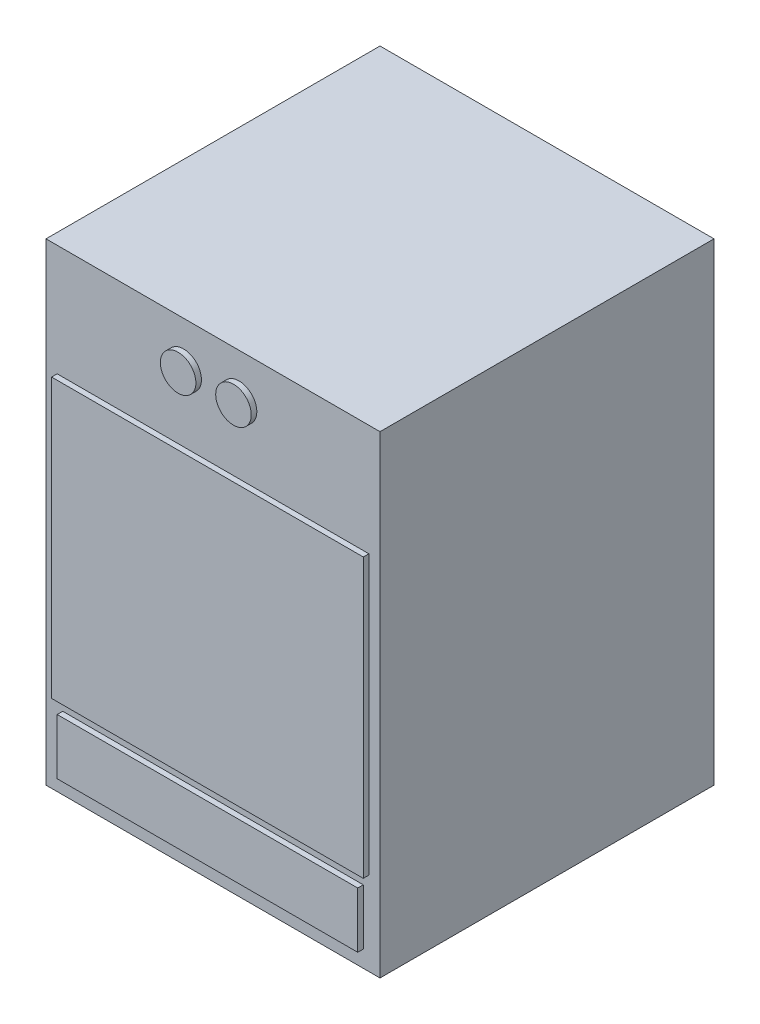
ISO-10303-21;
HEADER;
FILE_DESCRIPTION(('STEP AP214'),'2;1');
FILE_NAME('part.step','',(''),(''),'','','');
FILE_SCHEMA(('AUTOMOTIVE_DESIGN { 1 0 10303 214 1 1 1 1 }'));
ENDSEC;
DATA;
#1=APPLICATION_CONTEXT('core data for automotive mechanical design processes');
#2=APPLICATION_PROTOCOL_DEFINITION('international standard','automotive_design',2000,#1);
#3=PRODUCT_CONTEXT('',#1,'mechanical');
#4=PRODUCT('Part','Part','',(#3));
#5=PRODUCT_RELATED_PRODUCT_CATEGORY('part','',(#4));
#6=PRODUCT_DEFINITION_FORMATION('','',#4);
#7=PRODUCT_DEFINITION_CONTEXT('part definition',#1,'design');
#8=PRODUCT_DEFINITION('design','',#6,#7);
#9=PRODUCT_DEFINITION_SHAPE('','',#8);
#10=(LENGTH_UNIT() NAMED_UNIT(*) SI_UNIT(.MILLI.,.METRE.));
#11=(NAMED_UNIT(*) PLANE_ANGLE_UNIT() SI_UNIT($,.RADIAN.));
#12=(NAMED_UNIT(*) SI_UNIT($,.STERADIAN.) SOLID_ANGLE_UNIT());
#13=UNCERTAINTY_MEASURE_WITH_UNIT(LENGTH_MEASURE(1.E-05),#10,'distance_accuracy_value','');
#14=(GEOMETRIC_REPRESENTATION_CONTEXT(3) GLOBAL_UNCERTAINTY_ASSIGNED_CONTEXT((#13)) GLOBAL_UNIT_ASSIGNED_CONTEXT((#10,
#11,#12)) REPRESENTATION_CONTEXT('',''));
#15=CARTESIAN_POINT('',(0.,0.,0.));
#16=DIRECTION('',(0.,0.,1.));
#17=DIRECTION('',(1.,0.,0.));
#18=AXIS2_PLACEMENT_3D('',#15,#16,#17);
#19=CARTESIAN_POINT('',(300.,850.,300.));
#20=DIRECTION('',(0.,0.,-1.));
#21=DIRECTION('',(-1.,0.,0.));
#22=AXIS2_PLACEMENT_3D('',#19,#20,#21);
#23=PLANE('',#22);
#24=DIRECTION('',(0.,-1.,0.));
#25=VECTOR('',#24,1.);
#26=CARTESIAN_POINT('',(-270.,30.,300.));
#27=LINE('',#26,#25);
#28=CARTESIAN_POINT('',(-270.,130.,300.));
#29=VERTEX_POINT('',#28);
#30=CARTESIAN_POINT('',(-270.,30.,300.));
#31=VERTEX_POINT('',#30);
#32=EDGE_CURVE('E142',#29,#31,#27,.T.);
#33=ORIENTED_EDGE('',*,*,#32,.F.);
#34=DIRECTION('',(-1.,0.,0.));
#35=VECTOR('',#34,1.);
#36=CARTESIAN_POINT('',(-270.,130.,300.));
#37=LINE('',#36,#35);
#38=CARTESIAN_POINT('',(270.,130.,300.));
#39=VERTEX_POINT('',#38);
#40=EDGE_CURVE('E155',#39,#29,#37,.T.);
#41=ORIENTED_EDGE('',*,*,#40,.F.);
#42=DIRECTION('',(0.,1.,0.));
#43=VECTOR('',#42,1.);
#44=CARTESIAN_POINT('',(270.,30.,300.));
#45=LINE('',#44,#43);
#46=CARTESIAN_POINT('',(270.,30.,300.));
#47=VERTEX_POINT('',#46);
#48=EDGE_CURVE('E164',#47,#39,#45,.T.);
#49=ORIENTED_EDGE('',*,*,#48,.F.);
#50=DIRECTION('',(1.,0.,0.));
#51=VECTOR('',#50,1.);
#52=CARTESIAN_POINT('',(-270.,30.,300.));
#53=LINE('',#52,#51);
#54=EDGE_CURVE('E145',#31,#47,#53,.T.);
#55=ORIENTED_EDGE('',*,*,#54,.F.);
#56=EDGE_LOOP('',(#33,#41,#49,#55));
#57=FACE_BOUND('',#56,.T.);
#58=CARTESIAN_POINT('',(46.7714451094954,770.356504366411,300.));
#59=DIRECTION('',(0.,0.,-1.));
#60=DIRECTION('',(-1.,0.,0.));
#61=AXIS2_PLACEMENT_3D('',#58,#59,#60);
#62=CIRCLE('',#61,31.9295040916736);
#63=CARTESIAN_POINT('',(14.8419410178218,770.356504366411,300.));
#64=VERTEX_POINT('',#63);
#65=EDGE_CURVE('E11',#64,#64,#62,.F.);
#66=ORIENTED_EDGE('',*,*,#65,.F.);
#67=EDGE_LOOP('',(#66));
#68=FACE_BOUND('',#67,.T.);
#69=CARTESIAN_POINT('',(-52.7012407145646,770.356504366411,300.));
#70=DIRECTION('',(0.,0.,-1.));
#71=DIRECTION('',(-1.,0.,0.));
#72=AXIS2_PLACEMENT_3D('',#69,#70,#71);
#73=CIRCLE('',#72,31.9295040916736);
#74=CARTESIAN_POINT('',(-84.6307448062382,770.356504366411,300.));
#75=VERTEX_POINT('',#74);
#76=EDGE_CURVE('E40',#75,#75,#73,.F.);
#77=ORIENTED_EDGE('',*,*,#76,.F.);
#78=EDGE_LOOP('',(#77));
#79=FACE_BOUND('',#78,.T.);
#80=DIRECTION('',(1.,0.,0.));
#81=VECTOR('',#80,1.);
#82=CARTESIAN_POINT('',(300.,0.,300.));
#83=LINE('',#82,#81);
#84=CARTESIAN_POINT('',(-300.,0.,300.));
#85=VERTEX_POINT('',#84);
#86=CARTESIAN_POINT('',(300.,0.,300.));
#87=VERTEX_POINT('',#86);
#88=EDGE_CURVE('E200',#85,#87,#83,.T.);
#89=ORIENTED_EDGE('',*,*,#88,.T.);
#90=DIRECTION('',(0.,-1.,0.));
#91=VECTOR('',#90,1.);
#92=CARTESIAN_POINT('',(300.,850.,300.));
#93=LINE('',#92,#91);
#94=CARTESIAN_POINT('',(300.,850.,300.));
#95=VERTEX_POINT('',#94);
#96=EDGE_CURVE('E210',#95,#87,#93,.T.);
#97=ORIENTED_EDGE('',*,*,#96,.F.);
#98=DIRECTION('',(1.,0.,0.));
#99=VECTOR('',#98,1.);
#100=CARTESIAN_POINT('',(300.,850.,300.));
#101=LINE('',#100,#99);
#102=CARTESIAN_POINT('',(-300.,850.,300.));
#103=VERTEX_POINT('',#102);
#104=EDGE_CURVE('E190',#103,#95,#101,.T.);
#105=ORIENTED_EDGE('',*,*,#104,.F.);
#106=DIRECTION('',(0.,-1.,0.));
#107=VECTOR('',#106,1.);
#108=CARTESIAN_POINT('',(-300.,850.,300.));
#109=LINE('',#108,#107);
#110=EDGE_CURVE('E213',#103,#85,#109,.T.);
#111=ORIENTED_EDGE('',*,*,#110,.T.);
#112=EDGE_LOOP('',(#89,#97,#105,#111));
#113=FACE_BOUND('',#112,.T.);
#114=DIRECTION('',(0.,-1.,0.));
#115=VECTOR('',#114,1.);
#116=CARTESIAN_POINT('',(-280.,150.,300.));
#117=LINE('',#116,#115);
#118=CARTESIAN_POINT('',(-280.,650.,300.));
#119=VERTEX_POINT('',#118);
#120=CARTESIAN_POINT('',(-280.,150.,300.));
#121=VERTEX_POINT('',#120);
#122=EDGE_CURVE('E141',#119,#121,#117,.T.);
#123=ORIENTED_EDGE('',*,*,#122,.F.);
#124=DIRECTION('',(-1.,0.,0.));
#125=VECTOR('',#124,1.);
#126=CARTESIAN_POINT('',(-280.,650.,300.));
#127=LINE('',#126,#125);
#128=CARTESIAN_POINT('',(280.,650.,300.));
#129=VERTEX_POINT('',#128);
#130=EDGE_CURVE('E138',#129,#119,#127,.T.);
#131=ORIENTED_EDGE('',*,*,#130,.F.);
#132=DIRECTION('',(0.,1.,0.));
#133=VECTOR('',#132,1.);
#134=CARTESIAN_POINT('',(280.,150.,300.));
#135=LINE('',#134,#133);
#136=CARTESIAN_POINT('',(280.,150.,300.));
#137=VERTEX_POINT('',#136);
#138=EDGE_CURVE('E52',#137,#129,#135,.T.);
#139=ORIENTED_EDGE('',*,*,#138,.F.);
#140=DIRECTION('',(1.,0.,0.));
#141=VECTOR('',#140,1.);
#142=CARTESIAN_POINT('',(-280.,150.,300.));
#143=LINE('',#142,#141);
#144=EDGE_CURVE('E47',#121,#137,#143,.T.);
#145=ORIENTED_EDGE('',*,*,#144,.F.);
#146=EDGE_LOOP('',(#123,#131,#139,#145));
#147=FACE_BOUND('',#146,.T.);
#148=ADVANCED_FACE('F32',(#57,#68,#79,#113,#147),#23,.F.);
#149=CARTESIAN_POINT('',(-300.,850.,300.));
#150=DIRECTION('',(1.,0.,0.));
#151=DIRECTION('',(0.,0.,-1.));
#152=AXIS2_PLACEMENT_3D('',#149,#150,#151);
#153=PLANE('',#152);
#154=DIRECTION('',(0.,0.,1.));
#155=VECTOR('',#154,1.);
#156=CARTESIAN_POINT('',(-300.,0.,300.));
#157=LINE('',#156,#155);
#158=CARTESIAN_POINT('',(-300.,0.,-300.));
#159=VERTEX_POINT('',#158);
#160=EDGE_CURVE('E186',#159,#85,#157,.T.);
#161=ORIENTED_EDGE('',*,*,#160,.T.);
#162=ORIENTED_EDGE('',*,*,#110,.F.);
#163=DIRECTION('',(0.,0.,1.));
#164=VECTOR('',#163,1.);
#165=CARTESIAN_POINT('',(-300.,850.,300.));
#166=LINE('',#165,#164);
#167=CARTESIAN_POINT('',(-300.,850.,-300.));
#168=VERTEX_POINT('',#167);
#169=EDGE_CURVE('E187',#168,#103,#166,.T.);
#170=ORIENTED_EDGE('',*,*,#169,.F.);
#171=DIRECTION('',(0.,-1.,0.));
#172=VECTOR('',#171,1.);
#173=CARTESIAN_POINT('',(-300.,850.,-300.));
#174=LINE('',#173,#172);
#175=EDGE_CURVE('E197',#168,#159,#174,.T.);
#176=ORIENTED_EDGE('',*,*,#175,.T.);
#177=EDGE_LOOP('',(#161,#162,#170,#176));
#178=FACE_BOUND('',#177,.T.);
#179=ADVANCED_FACE('F34',(#178),#153,.F.);
#180=CARTESIAN_POINT('',(300.,850.,300.));
#181=DIRECTION('',(-1.,0.,0.));
#182=DIRECTION('',(0.,0.,1.));
#183=AXIS2_PLACEMENT_3D('',#180,#181,#182);
#184=PLANE('',#183);
#185=DIRECTION('',(0.,0.,-1.));
#186=VECTOR('',#185,1.);
#187=CARTESIAN_POINT('',(300.,0.,300.));
#188=LINE('',#187,#186);
#189=CARTESIAN_POINT('',(300.,0.,-300.));
#190=VERTEX_POINT('',#189);
#191=EDGE_CURVE('E202',#87,#190,#188,.T.);
#192=ORIENTED_EDGE('',*,*,#191,.T.);
#193=DIRECTION('',(0.,-1.,0.));
#194=VECTOR('',#193,1.);
#195=CARTESIAN_POINT('',(300.,850.,-300.));
#196=LINE('',#195,#194);
#197=CARTESIAN_POINT('',(300.,850.,-300.));
#198=VERTEX_POINT('',#197);
#199=EDGE_CURVE('E207',#198,#190,#196,.T.);
#200=ORIENTED_EDGE('',*,*,#199,.F.);
#201=DIRECTION('',(0.,0.,-1.));
#202=VECTOR('',#201,1.);
#203=CARTESIAN_POINT('',(300.,850.,300.));
#204=LINE('',#203,#202);
#205=EDGE_CURVE('E193',#95,#198,#204,.T.);
#206=ORIENTED_EDGE('',*,*,#205,.F.);
#207=ORIENTED_EDGE('',*,*,#96,.T.);
#208=EDGE_LOOP('',(#192,#200,#206,#207));
#209=FACE_BOUND('',#208,.T.);
#210=ADVANCED_FACE('F297',(#209),#184,.F.);
#211=CARTESIAN_POINT('',(300.,850.,-300.));
#212=DIRECTION('',(0.,0.,1.));
#213=DIRECTION('',(1.,0.,0.));
#214=AXIS2_PLACEMENT_3D('',#211,#212,#213);
#215=PLANE('',#214);
#216=DIRECTION('',(-1.,0.,0.));
#217=VECTOR('',#216,1.);
#218=CARTESIAN_POINT('',(300.,0.,-300.));
#219=LINE('',#218,#217);
#220=EDGE_CURVE('E191',#190,#159,#219,.T.);
#221=ORIENTED_EDGE('',*,*,#220,.T.);
#222=ORIENTED_EDGE('',*,*,#175,.F.);
#223=DIRECTION('',(-1.,0.,0.));
#224=VECTOR('',#223,1.);
#225=CARTESIAN_POINT('',(300.,850.,-300.));
#226=LINE('',#225,#224);
#227=EDGE_CURVE('E195',#198,#168,#226,.T.);
#228=ORIENTED_EDGE('',*,*,#227,.F.);
#229=ORIENTED_EDGE('',*,*,#199,.T.);
#230=EDGE_LOOP('',(#221,#222,#228,#229));
#231=FACE_BOUND('',#230,.T.);
#232=ADVANCED_FACE('F290',(#231),#215,.F.);
#233=CARTESIAN_POINT('',(0.,850.,0.));
#234=DIRECTION('',(0.,1.,0.));
#235=DIRECTION('',(0.,0.,1.));
#236=AXIS2_PLACEMENT_3D('',#233,#234,#235);
#237=PLANE('',#236);
#238=ORIENTED_EDGE('',*,*,#169,.T.);
#239=ORIENTED_EDGE('',*,*,#104,.T.);
#240=ORIENTED_EDGE('',*,*,#205,.T.);
#241=ORIENTED_EDGE('',*,*,#227,.T.);
#242=EDGE_LOOP('',(#238,#239,#240,#241));
#243=FACE_BOUND('',#242,.T.);
#244=ADVANCED_FACE('F287',(#243),#237,.T.);
#245=CARTESIAN_POINT('',(0.,0.,0.));
#246=DIRECTION('',(0.,1.,0.));
#247=DIRECTION('',(0.,0.,1.));
#248=AXIS2_PLACEMENT_3D('',#245,#246,#247);
#249=PLANE('',#248);
#250=ORIENTED_EDGE('',*,*,#160,.F.);
#251=ORIENTED_EDGE('',*,*,#220,.F.);
#252=ORIENTED_EDGE('',*,*,#191,.F.);
#253=ORIENTED_EDGE('',*,*,#88,.F.);
#254=EDGE_LOOP('',(#250,#251,#252,#253));
#255=FACE_BOUND('',#254,.T.);
#256=ADVANCED_FACE('F285',(#255),#249,.F.);
#257=CARTESIAN_POINT('',(-52.7012407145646,770.356504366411,310.));
#258=DIRECTION('',(0.,0.,-1.));
#259=DIRECTION('',(-1.,0.,0.));
#260=AXIS2_PLACEMENT_3D('',#257,#258,#259);
#261=CYLINDRICAL_SURFACE('',#260,31.9295040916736);
#262=CARTESIAN_POINT('',(-52.7012407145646,770.356504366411,310.));
#263=DIRECTION('',(0.,0.,1.));
#264=DIRECTION('',(1.,0.,0.));
#265=AXIS2_PLACEMENT_3D('',#262,#263,#264);
#266=CIRCLE('',#265,31.9295040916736);
#267=CARTESIAN_POINT('',(-20.771736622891,770.356504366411,310.));
#268=VERTEX_POINT('',#267);
#269=EDGE_CURVE('E183',#268,#268,#266,.T.);
#270=ORIENTED_EDGE('',*,*,#269,.F.);
#271=EDGE_LOOP('',(#270));
#272=FACE_BOUND('',#271,.T.);
#273=ORIENTED_EDGE('',*,*,#76,.T.);
#274=EDGE_LOOP('',(#273));
#275=FACE_BOUND('',#274,.T.);
#276=ADVANCED_FACE('F218',(#272,#275),#261,.T.);
#277=CARTESIAN_POINT('',(-52.7012407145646,770.356504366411,310.));
#278=DIRECTION('',(0.,0.,1.));
#279=DIRECTION('',(1.,0.,0.));
#280=AXIS2_PLACEMENT_3D('',#277,#278,#279);
#281=PLANE('',#280);
#282=ORIENTED_EDGE('',*,*,#269,.T.);
#283=EDGE_LOOP('',(#282));
#284=FACE_BOUND('',#283,.T.);
#285=ADVANCED_FACE('F278',(#284),#281,.T.);
#286=CARTESIAN_POINT('',(46.7714451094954,770.356504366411,310.));
#287=DIRECTION('',(0.,0.,-1.));
#288=DIRECTION('',(-1.,0.,0.));
#289=AXIS2_PLACEMENT_3D('',#286,#287,#288);
#290=CYLINDRICAL_SURFACE('',#289,31.9295040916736);
#291=CARTESIAN_POINT('',(46.7714451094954,770.356504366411,310.));
#292=DIRECTION('',(0.,0.,1.));
#293=DIRECTION('',(1.,0.,0.));
#294=AXIS2_PLACEMENT_3D('',#291,#292,#293);
#295=CIRCLE('',#294,31.9295040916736);
#296=CARTESIAN_POINT('',(78.700949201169,770.356504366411,310.));
#297=VERTEX_POINT('',#296);
#298=EDGE_CURVE('E180',#297,#297,#295,.T.);
#299=ORIENTED_EDGE('',*,*,#298,.F.);
#300=EDGE_LOOP('',(#299));
#301=FACE_BOUND('',#300,.T.);
#302=ORIENTED_EDGE('',*,*,#65,.T.);
#303=EDGE_LOOP('',(#302));
#304=FACE_BOUND('',#303,.T.);
#305=ADVANCED_FACE('F274',(#301,#304),#290,.T.);
#306=CARTESIAN_POINT('',(46.7714451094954,770.356504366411,310.));
#307=DIRECTION('',(0.,0.,1.));
#308=DIRECTION('',(1.,0.,0.));
#309=AXIS2_PLACEMENT_3D('',#306,#307,#308);
#310=PLANE('',#309);
#311=ORIENTED_EDGE('',*,*,#298,.T.);
#312=EDGE_LOOP('',(#311));
#313=FACE_BOUND('',#312,.T.);
#314=ADVANCED_FACE('F270',(#313),#310,.T.);
#315=CARTESIAN_POINT('',(-270.,30.,310.));
#316=DIRECTION('',(1.,0.,0.));
#317=DIRECTION('',(0.,0.,-1.));
#318=AXIS2_PLACEMENT_3D('',#315,#316,#317);
#319=PLANE('',#318);
#320=ORIENTED_EDGE('',*,*,#32,.T.);
#321=DIRECTION('',(0.,0.,-1.));
#322=VECTOR('',#321,1.);
#323=CARTESIAN_POINT('',(-270.,30.,310.));
#324=LINE('',#323,#322);
#325=CARTESIAN_POINT('',(-270.,30.,310.));
#326=VERTEX_POINT('',#325);
#327=EDGE_CURVE('E177',#326,#31,#324,.T.);
#328=ORIENTED_EDGE('',*,*,#327,.F.);
#329=DIRECTION('',(0.,-1.,0.));
#330=VECTOR('',#329,1.);
#331=CARTESIAN_POINT('',(-270.,30.,310.));
#332=LINE('',#331,#330);
#333=CARTESIAN_POINT('',(-270.,130.,310.));
#334=VERTEX_POINT('',#333);
#335=EDGE_CURVE('E151',#334,#326,#332,.T.);
#336=ORIENTED_EDGE('',*,*,#335,.F.);
#337=DIRECTION('',(0.,0.,-1.));
#338=VECTOR('',#337,1.);
#339=CARTESIAN_POINT('',(-270.,130.,310.));
#340=LINE('',#339,#338);
#341=EDGE_CURVE('E160',#334,#29,#340,.T.);
#342=ORIENTED_EDGE('',*,*,#341,.T.);
#343=EDGE_LOOP('',(#320,#328,#336,#342));
#344=FACE_BOUND('',#343,.T.);
#345=ADVANCED_FACE('F266',(#344),#319,.F.);
#346=CARTESIAN_POINT('',(-270.,30.,310.));
#347=DIRECTION('',(0.,1.,0.));
#348=DIRECTION('',(0.,0.,1.));
#349=AXIS2_PLACEMENT_3D('',#346,#347,#348);
#350=PLANE('',#349);
#351=ORIENTED_EDGE('',*,*,#54,.T.);
#352=DIRECTION('',(0.,0.,-1.));
#353=VECTOR('',#352,1.);
#354=CARTESIAN_POINT('',(270.,30.,310.));
#355=LINE('',#354,#353);
#356=CARTESIAN_POINT('',(270.,30.,310.));
#357=VERTEX_POINT('',#356);
#358=EDGE_CURVE('E174',#357,#47,#355,.T.);
#359=ORIENTED_EDGE('',*,*,#358,.F.);
#360=DIRECTION('',(1.,0.,0.));
#361=VECTOR('',#360,1.);
#362=CARTESIAN_POINT('',(-270.,30.,310.));
#363=LINE('',#362,#361);
#364=EDGE_CURVE('E154',#326,#357,#363,.T.);
#365=ORIENTED_EDGE('',*,*,#364,.F.);
#366=ORIENTED_EDGE('',*,*,#327,.T.);
#367=EDGE_LOOP('',(#351,#359,#365,#366));
#368=FACE_BOUND('',#367,.T.);
#369=ADVANCED_FACE('F262',(#368),#350,.F.);
#370=CARTESIAN_POINT('',(270.,30.,310.));
#371=DIRECTION('',(-1.,0.,0.));
#372=DIRECTION('',(0.,0.,1.));
#373=AXIS2_PLACEMENT_3D('',#370,#371,#372);
#374=PLANE('',#373);
#375=ORIENTED_EDGE('',*,*,#48,.T.);
#376=DIRECTION('',(0.,0.,-1.));
#377=VECTOR('',#376,1.);
#378=CARTESIAN_POINT('',(270.,130.,310.));
#379=LINE('',#378,#377);
#380=CARTESIAN_POINT('',(270.,130.,310.));
#381=VERTEX_POINT('',#380);
#382=EDGE_CURVE('E171',#381,#39,#379,.T.);
#383=ORIENTED_EDGE('',*,*,#382,.F.);
#384=DIRECTION('',(0.,1.,0.));
#385=VECTOR('',#384,1.);
#386=CARTESIAN_POINT('',(270.,30.,310.));
#387=LINE('',#386,#385);
#388=EDGE_CURVE('E157',#357,#381,#387,.T.);
#389=ORIENTED_EDGE('',*,*,#388,.F.);
#390=ORIENTED_EDGE('',*,*,#358,.T.);
#391=EDGE_LOOP('',(#375,#383,#389,#390));
#392=FACE_BOUND('',#391,.T.);
#393=ADVANCED_FACE('F258',(#392),#374,.F.);
#394=CARTESIAN_POINT('',(-270.,130.,310.));
#395=DIRECTION('',(0.,-1.,0.));
#396=DIRECTION('',(0.,0.,-1.));
#397=AXIS2_PLACEMENT_3D('',#394,#395,#396);
#398=PLANE('',#397);
#399=ORIENTED_EDGE('',*,*,#40,.T.);
#400=ORIENTED_EDGE('',*,*,#341,.F.);
#401=DIRECTION('',(-1.,0.,0.));
#402=VECTOR('',#401,1.);
#403=CARTESIAN_POINT('',(-270.,130.,310.));
#404=LINE('',#403,#402);
#405=EDGE_CURVE('E159',#381,#334,#404,.T.);
#406=ORIENTED_EDGE('',*,*,#405,.F.);
#407=ORIENTED_EDGE('',*,*,#382,.T.);
#408=EDGE_LOOP('',(#399,#400,#406,#407));
#409=FACE_BOUND('',#408,.T.);
#410=ADVANCED_FACE('F254',(#409),#398,.F.);
#411=CARTESIAN_POINT('',(0.,0.,310.));
#412=DIRECTION('',(0.,0.,-1.));
#413=DIRECTION('',(-1.,0.,0.));
#414=AXIS2_PLACEMENT_3D('',#411,#412,#413);
#415=PLANE('',#414);
#416=ORIENTED_EDGE('',*,*,#335,.T.);
#417=ORIENTED_EDGE('',*,*,#364,.T.);
#418=ORIENTED_EDGE('',*,*,#388,.T.);
#419=ORIENTED_EDGE('',*,*,#405,.T.);
#420=EDGE_LOOP('',(#416,#417,#418,#419));
#421=FACE_BOUND('',#420,.T.);
#422=ADVANCED_FACE('F251',(#421),#415,.F.);
#423=CARTESIAN_POINT('',(-280.,150.,310.));
#424=DIRECTION('',(1.,0.,0.));
#425=DIRECTION('',(0.,0.,-1.));
#426=AXIS2_PLACEMENT_3D('',#423,#424,#425);
#427=PLANE('',#426);
#428=ORIENTED_EDGE('',*,*,#122,.T.);
#429=DIRECTION('',(0.,0.,-1.));
#430=VECTOR('',#429,1.);
#431=CARTESIAN_POINT('',(-280.,150.,310.));
#432=LINE('',#431,#430);
#433=CARTESIAN_POINT('',(-280.,150.,310.));
#434=VERTEX_POINT('',#433);
#435=EDGE_CURVE('E122',#434,#121,#432,.T.);
#436=ORIENTED_EDGE('',*,*,#435,.F.);
#437=DIRECTION('',(0.,-1.,0.));
#438=VECTOR('',#437,1.);
#439=CARTESIAN_POINT('',(-280.,150.,310.));
#440=LINE('',#439,#438);
#441=CARTESIAN_POINT('',(-280.,650.,310.));
#442=VERTEX_POINT('',#441);
#443=EDGE_CURVE('E129',#442,#434,#440,.T.);
#444=ORIENTED_EDGE('',*,*,#443,.F.);
#445=DIRECTION('',(0.,0.,-1.));
#446=VECTOR('',#445,1.);
#447=CARTESIAN_POINT('',(-280.,650.,310.));
#448=LINE('',#447,#446);
#449=EDGE_CURVE('E229',#442,#119,#448,.T.);
#450=ORIENTED_EDGE('',*,*,#449,.T.);
#451=EDGE_LOOP('',(#428,#436,#444,#450));
#452=FACE_BOUND('',#451,.T.);
#453=ADVANCED_FACE('F140',(#452),#427,.F.);
#454=CARTESIAN_POINT('',(-280.,150.,310.));
#455=DIRECTION('',(0.,1.,0.));
#456=DIRECTION('',(0.,0.,1.));
#457=AXIS2_PLACEMENT_3D('',#454,#455,#456);
#458=PLANE('',#457);
#459=ORIENTED_EDGE('',*,*,#144,.T.);
#460=DIRECTION('',(0.,0.,-1.));
#461=VECTOR('',#460,1.);
#462=CARTESIAN_POINT('',(280.,150.,310.));
#463=LINE('',#462,#461);
#464=CARTESIAN_POINT('',(280.,150.,310.));
#465=VERTEX_POINT('',#464);
#466=EDGE_CURVE('E125',#465,#137,#463,.T.);
#467=ORIENTED_EDGE('',*,*,#466,.F.);
#468=DIRECTION('',(1.,0.,0.));
#469=VECTOR('',#468,1.);
#470=CARTESIAN_POINT('',(-280.,150.,310.));
#471=LINE('',#470,#469);
#472=EDGE_CURVE('E118',#434,#465,#471,.T.);
#473=ORIENTED_EDGE('',*,*,#472,.F.);
#474=ORIENTED_EDGE('',*,*,#435,.T.);
#475=EDGE_LOOP('',(#459,#467,#473,#474));
#476=FACE_BOUND('',#475,.T.);
#477=ADVANCED_FACE('F120',(#476),#458,.F.);
#478=CARTESIAN_POINT('',(280.,150.,310.));
#479=DIRECTION('',(-1.,0.,0.));
#480=DIRECTION('',(0.,0.,1.));
#481=AXIS2_PLACEMENT_3D('',#478,#479,#480);
#482=PLANE('',#481);
#483=ORIENTED_EDGE('',*,*,#138,.T.);
#484=DIRECTION('',(0.,0.,-1.));
#485=VECTOR('',#484,1.);
#486=CARTESIAN_POINT('',(280.,650.,310.));
#487=LINE('',#486,#485);
#488=CARTESIAN_POINT('',(280.,650.,310.));
#489=VERTEX_POINT('',#488);
#490=EDGE_CURVE('E147',#489,#129,#487,.T.);
#491=ORIENTED_EDGE('',*,*,#490,.F.);
#492=DIRECTION('',(0.,1.,0.));
#493=VECTOR('',#492,1.);
#494=CARTESIAN_POINT('',(280.,150.,310.));
#495=LINE('',#494,#493);
#496=EDGE_CURVE('E128',#465,#489,#495,.T.);
#497=ORIENTED_EDGE('',*,*,#496,.F.);
#498=ORIENTED_EDGE('',*,*,#466,.T.);
#499=EDGE_LOOP('',(#483,#491,#497,#498));
#500=FACE_BOUND('',#499,.T.);
#501=ADVANCED_FACE('F238',(#500),#482,.F.);
#502=CARTESIAN_POINT('',(-280.,650.,310.));
#503=DIRECTION('',(0.,-1.,0.));
#504=DIRECTION('',(0.,0.,-1.));
#505=AXIS2_PLACEMENT_3D('',#502,#503,#504);
#506=PLANE('',#505);
#507=ORIENTED_EDGE('',*,*,#130,.T.);
#508=ORIENTED_EDGE('',*,*,#449,.F.);
#509=DIRECTION('',(-1.,0.,0.));
#510=VECTOR('',#509,1.);
#511=CARTESIAN_POINT('',(-280.,650.,310.));
#512=LINE('',#511,#510);
#513=EDGE_CURVE('E134',#489,#442,#512,.T.);
#514=ORIENTED_EDGE('',*,*,#513,.F.);
#515=ORIENTED_EDGE('',*,*,#490,.T.);
#516=EDGE_LOOP('',(#507,#508,#514,#515));
#517=FACE_BOUND('',#516,.T.);
#518=ADVANCED_FACE('F228',(#517),#506,.F.);
#519=CARTESIAN_POINT('',(0.,0.,310.));
#520=DIRECTION('',(0.,0.,-1.));
#521=DIRECTION('',(-1.,0.,0.));
#522=AXIS2_PLACEMENT_3D('',#519,#520,#521);
#523=PLANE('',#522);
#524=ORIENTED_EDGE('',*,*,#443,.T.);
#525=ORIENTED_EDGE('',*,*,#472,.T.);
#526=ORIENTED_EDGE('',*,*,#496,.T.);
#527=ORIENTED_EDGE('',*,*,#513,.T.);
#528=EDGE_LOOP('',(#524,#525,#526,#527));
#529=FACE_BOUND('',#528,.T.);
#530=ADVANCED_FACE('F132',(#529),#523,.F.);
#531=CLOSED_SHELL('',(#148,#179,#210,#232,#244,#256,#276,#285,#305,#314,#345,#369,#393,#410,
#422,#453,#477,#501,#518,#530));
#532=MANIFOLD_SOLID_BREP('B2',#531);
#533=ADVANCED_BREP_SHAPE_REPRESENTATION('',(#18,#532),#14);
#534=SHAPE_DEFINITION_REPRESENTATION(#9,#533);
ENDSEC;
END-ISO-10303-21;
